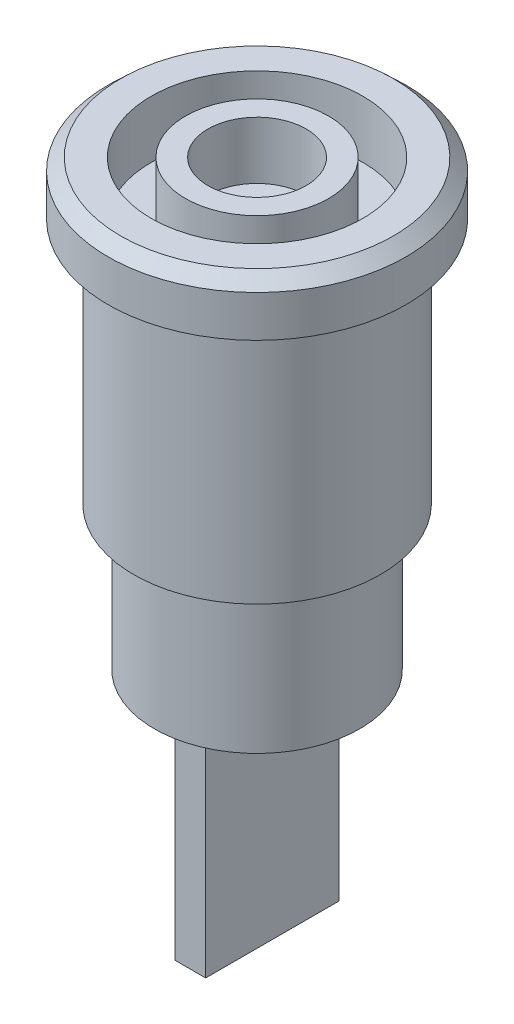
ISO-10303-21;
HEADER;
FILE_DESCRIPTION(('STEP AP214'),'2;1');
FILE_NAME('part.step','',(''),(''),'','','');
FILE_SCHEMA(('AUTOMOTIVE_DESIGN { 1 0 10303 214 1 1 1 1 }'));
ENDSEC;
DATA;
#1=APPLICATION_CONTEXT('core data for automotive mechanical design processes');
#2=APPLICATION_PROTOCOL_DEFINITION('international standard','automotive_design',2000,#1);
#3=PRODUCT_CONTEXT('',#1,'mechanical');
#4=PRODUCT('Part','Part','',(#3));
#5=PRODUCT_RELATED_PRODUCT_CATEGORY('part','',(#4));
#6=PRODUCT_DEFINITION_FORMATION('','',#4);
#7=PRODUCT_DEFINITION_CONTEXT('part definition',#1,'design');
#8=PRODUCT_DEFINITION('design','',#6,#7);
#9=PRODUCT_DEFINITION_SHAPE('','',#8);
#10=(LENGTH_UNIT() NAMED_UNIT(*) SI_UNIT(.MILLI.,.METRE.));
#11=(NAMED_UNIT(*) PLANE_ANGLE_UNIT() SI_UNIT($,.RADIAN.));
#12=(NAMED_UNIT(*) SI_UNIT($,.STERADIAN.) SOLID_ANGLE_UNIT());
#13=UNCERTAINTY_MEASURE_WITH_UNIT(LENGTH_MEASURE(1.E-05),#10,'distance_accuracy_value','');
#14=(GEOMETRIC_REPRESENTATION_CONTEXT(3) GLOBAL_UNCERTAINTY_ASSIGNED_CONTEXT((#13)) GLOBAL_UNIT_ASSIGNED_CONTEXT((#10,
#11,#12)) REPRESENTATION_CONTEXT('',''));
#15=CARTESIAN_POINT('',(0.,0.,0.));
#16=DIRECTION('',(0.,0.,1.));
#17=DIRECTION('',(1.,0.,0.));
#18=AXIS2_PLACEMENT_3D('',#15,#16,#17);
#19=CARTESIAN_POINT('',(0.,0.,0.));
#20=DIRECTION('',(0.,-1.,0.));
#21=DIRECTION('',(0.,0.,-1.));
#22=AXIS2_PLACEMENT_3D('',#19,#20,#21);
#23=PLANE('',#22);
#24=CARTESIAN_POINT('',(0.,0.,0.));
#25=DIRECTION('',(0.,-1.,0.));
#26=DIRECTION('',(0.,0.,-1.));
#27=AXIS2_PLACEMENT_3D('',#24,#25,#26);
#28=CIRCLE('',#27,5.);
#29=CARTESIAN_POINT('',(0.,0.,-5.));
#30=VERTEX_POINT('',#29);
#31=EDGE_CURVE('E11',#30,#30,#28,.T.);
#32=ORIENTED_EDGE('',*,*,#31,.T.);
#33=EDGE_LOOP('',(#32));
#34=FACE_BOUND('',#33,.T.);
#35=DIRECTION('',(-1.,0.,0.));
#36=VECTOR('',#35,1.);
#37=CARTESIAN_POINT('',(-0.750000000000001,0.,3.25));
#38=LINE('',#37,#36);
#39=CARTESIAN_POINT('',(0.749999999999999,0.,3.25));
#40=VERTEX_POINT('',#39);
#41=CARTESIAN_POINT('',(-0.750000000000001,0.,3.25));
#42=VERTEX_POINT('',#41);
#43=EDGE_CURVE('E85',#40,#42,#38,.T.);
#44=ORIENTED_EDGE('',*,*,#43,.F.);
#45=DIRECTION('',(0.,0.,1.));
#46=VECTOR('',#45,1.);
#47=CARTESIAN_POINT('',(0.749999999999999,0.,3.25));
#48=LINE('',#47,#46);
#49=CARTESIAN_POINT('',(0.75,0.,-3.25));
#50=VERTEX_POINT('',#49);
#51=EDGE_CURVE('E96',#50,#40,#48,.T.);
#52=ORIENTED_EDGE('',*,*,#51,.F.);
#53=DIRECTION('',(1.,0.,0.));
#54=VECTOR('',#53,1.);
#55=CARTESIAN_POINT('',(-0.75,0.,-3.25));
#56=LINE('',#55,#54);
#57=CARTESIAN_POINT('',(-0.75,0.,-3.25));
#58=VERTEX_POINT('',#57);
#59=EDGE_CURVE('E66',#58,#50,#56,.T.);
#60=ORIENTED_EDGE('',*,*,#59,.F.);
#61=DIRECTION('',(0.,0.,-1.));
#62=VECTOR('',#61,1.);
#63=CARTESIAN_POINT('',(-0.750000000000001,0.,3.25));
#64=LINE('',#63,#62);
#65=EDGE_CURVE('E100',#42,#58,#64,.T.);
#66=ORIENTED_EDGE('',*,*,#65,.F.);
#67=EDGE_LOOP('',(#44,#52,#60,#66));
#68=FACE_BOUND('',#67,.T.);
#69=ADVANCED_FACE('F30',(#34,#68),#23,.T.);
#70=CARTESIAN_POINT('',(0.,0.,0.));
#71=DIRECTION('',(0.,-1.,0.));
#72=DIRECTION('',(0.,0.,-1.));
#73=AXIS2_PLACEMENT_3D('',#70,#71,#72);
#74=CYLINDRICAL_SURFACE('',#73,5.);
#75=CARTESIAN_POINT('',(0.,7.,0.));
#76=DIRECTION('',(0.,-1.,0.));
#77=DIRECTION('',(0.,0.,-1.));
#78=AXIS2_PLACEMENT_3D('',#75,#76,#77);
#79=CIRCLE('',#78,5.);
#80=CARTESIAN_POINT('',(0.,7.,-5.));
#81=VERTEX_POINT('',#80);
#82=EDGE_CURVE('E37',#81,#81,#79,.T.);
#83=ORIENTED_EDGE('',*,*,#82,.T.);
#84=EDGE_LOOP('',(#83));
#85=FACE_BOUND('',#84,.T.);
#86=ORIENTED_EDGE('',*,*,#31,.F.);
#87=EDGE_LOOP('',(#86));
#88=FACE_BOUND('',#87,.T.);
#89=ADVANCED_FACE('F141',(#85,#88),#74,.T.);
#90=CARTESIAN_POINT('',(5.,7.,0.));
#91=DIRECTION('',(0.,-1.,0.));
#92=DIRECTION('',(0.,0.,-1.));
#93=AXIS2_PLACEMENT_3D('',#90,#91,#92);
#94=PLANE('',#93);
#95=CARTESIAN_POINT('',(0.,7.,0.));
#96=DIRECTION('',(0.,-1.,0.));
#97=DIRECTION('',(0.,0.,-1.));
#98=AXIS2_PLACEMENT_3D('',#95,#96,#97);
#99=CIRCLE('',#98,6.);
#100=CARTESIAN_POINT('',(0.,7.,-6.));
#101=VERTEX_POINT('',#100);
#102=EDGE_CURVE('E136',#101,#101,#99,.T.);
#103=ORIENTED_EDGE('',*,*,#102,.T.);
#104=EDGE_LOOP('',(#103));
#105=FACE_BOUND('',#104,.T.);
#106=ORIENTED_EDGE('',*,*,#82,.F.);
#107=EDGE_LOOP('',(#106));
#108=FACE_BOUND('',#107,.T.);
#109=ADVANCED_FACE('F144',(#105,#108),#94,.T.);
#110=CARTESIAN_POINT('',(0.,0.,0.));
#111=DIRECTION('',(0.,-1.,0.));
#112=DIRECTION('',(0.,0.,-1.));
#113=AXIS2_PLACEMENT_3D('',#110,#111,#112);
#114=CYLINDRICAL_SURFACE('',#113,6.);
#115=CARTESIAN_POINT('',(0.,19.,0.));
#116=DIRECTION('',(0.,-1.,0.));
#117=DIRECTION('',(0.,0.,-1.));
#118=AXIS2_PLACEMENT_3D('',#115,#116,#117);
#119=CIRCLE('',#118,6.);
#120=CARTESIAN_POINT('',(0.,19.,-6.));
#121=VERTEX_POINT('',#120);
#122=EDGE_CURVE('E133',#121,#121,#119,.T.);
#123=ORIENTED_EDGE('',*,*,#122,.T.);
#124=EDGE_LOOP('',(#123));
#125=FACE_BOUND('',#124,.T.);
#126=ORIENTED_EDGE('',*,*,#102,.F.);
#127=EDGE_LOOP('',(#126));
#128=FACE_BOUND('',#127,.T.);
#129=ADVANCED_FACE('F146',(#125,#128),#114,.T.);
#130=CARTESIAN_POINT('',(6.,19.,0.));
#131=DIRECTION('',(0.,-1.,0.));
#132=DIRECTION('',(0.,0.,-1.));
#133=AXIS2_PLACEMENT_3D('',#130,#131,#132);
#134=PLANE('',#133);
#135=CARTESIAN_POINT('',(0.,19.,0.));
#136=DIRECTION('',(0.,-1.,0.));
#137=DIRECTION('',(0.,0.,-1.));
#138=AXIS2_PLACEMENT_3D('',#135,#136,#137);
#139=CIRCLE('',#138,7.24653536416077);
#140=CARTESIAN_POINT('',(0.,19.,-7.24653536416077));
#141=VERTEX_POINT('',#140);
#142=EDGE_CURVE('E130',#141,#141,#139,.T.);
#143=ORIENTED_EDGE('',*,*,#142,.T.);
#144=EDGE_LOOP('',(#143));
#145=FACE_BOUND('',#144,.T.);
#146=ORIENTED_EDGE('',*,*,#122,.F.);
#147=EDGE_LOOP('',(#146));
#148=FACE_BOUND('',#147,.T.);
#149=ADVANCED_FACE('F153',(#145,#148),#134,.T.);
#150=CARTESIAN_POINT('',(0.,0.,0.));
#151=DIRECTION('',(0.,-1.,0.));
#152=DIRECTION('',(0.,0.,-1.));
#153=AXIS2_PLACEMENT_3D('',#150,#151,#152);
#154=CYLINDRICAL_SURFACE('',#153,7.24653536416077);
#155=CARTESIAN_POINT('',(0.,21.0172799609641,0.));
#156=DIRECTION('',(0.,-1.,0.));
#157=DIRECTION('',(0.,0.,-1.));
#158=AXIS2_PLACEMENT_3D('',#155,#156,#157);
#159=CIRCLE('',#158,7.24653536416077);
#160=CARTESIAN_POINT('',(0.,21.0172799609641,-7.24653536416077));
#161=VERTEX_POINT('',#160);
#162=EDGE_CURVE('E127',#161,#161,#159,.T.);
#163=ORIENTED_EDGE('',*,*,#162,.T.);
#164=EDGE_LOOP('',(#163));
#165=FACE_BOUND('',#164,.T.);
#166=ORIENTED_EDGE('',*,*,#142,.F.);
#167=EDGE_LOOP('',(#166));
#168=FACE_BOUND('',#167,.T.);
#169=ADVANCED_FACE('F210',(#165,#168),#154,.T.);
#170=CARTESIAN_POINT('',(0.,21.0172799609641,0.));
#171=DIRECTION('',(0.,-1.,0.));
#172=DIRECTION('',(0.,0.,-1.));
#173=AXIS2_PLACEMENT_3D('',#170,#171,#172);
#174=CONICAL_SURFACE('',#173,7.24653536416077,0.81387347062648);
#175=CARTESIAN_POINT('',(0.,21.5938165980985,0.));
#176=DIRECTION('',(0.,-1.,0.));
#177=DIRECTION('',(0.,0.,-1.));
#178=AXIS2_PLACEMENT_3D('',#175,#176,#177);
#179=CIRCLE('',#178,6.63619284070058);
#180=CARTESIAN_POINT('',(0.,21.5938165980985,-6.63619284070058));
#181=VERTEX_POINT('',#180);
#182=EDGE_CURVE('E124',#181,#181,#179,.T.);
#183=ORIENTED_EDGE('',*,*,#182,.T.);
#184=EDGE_LOOP('',(#183));
#185=FACE_BOUND('',#184,.T.);
#186=ORIENTED_EDGE('',*,*,#162,.F.);
#187=EDGE_LOOP('',(#186));
#188=FACE_BOUND('',#187,.T.);
#189=ADVANCED_FACE('F206',(#185,#188),#174,.T.);
#190=CARTESIAN_POINT('',(6.63619284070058,21.5938165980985,0.));
#191=DIRECTION('',(0.,1.,0.));
#192=DIRECTION('',(0.,0.,1.));
#193=AXIS2_PLACEMENT_3D('',#190,#191,#192);
#194=PLANE('',#193);
#195=CARTESIAN_POINT('',(0.,21.5938165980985,0.));
#196=DIRECTION('',(0.,-1.,0.));
#197=DIRECTION('',(0.,0.,-1.));
#198=AXIS2_PLACEMENT_3D('',#195,#196,#197);
#199=CIRCLE('',#198,5.15373863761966);
#200=CARTESIAN_POINT('',(0.,21.5938165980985,-5.15373863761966));
#201=VERTEX_POINT('',#200);
#202=EDGE_CURVE('E121',#201,#201,#199,.T.);
#203=ORIENTED_EDGE('',*,*,#202,.T.);
#204=EDGE_LOOP('',(#203));
#205=FACE_BOUND('',#204,.T.);
#206=ORIENTED_EDGE('',*,*,#182,.F.);
#207=EDGE_LOOP('',(#206));
#208=FACE_BOUND('',#207,.T.);
#209=ADVANCED_FACE('F202',(#205,#208),#194,.T.);
#210=CARTESIAN_POINT('',(0.,0.,0.));
#211=DIRECTION('',(0.,-1.,0.));
#212=DIRECTION('',(0.,0.,-1.));
#213=AXIS2_PLACEMENT_3D('',#210,#211,#212);
#214=CYLINDRICAL_SURFACE('',#213,5.15373863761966);
#215=CARTESIAN_POINT('',(0.,18.8017697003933,0.));
#216=DIRECTION('',(0.,-1.,0.));
#217=DIRECTION('',(0.,0.,-1.));
#218=AXIS2_PLACEMENT_3D('',#215,#216,#217);
#219=CIRCLE('',#218,5.15373863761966);
#220=CARTESIAN_POINT('',(0.,18.8017697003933,-5.15373863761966));
#221=VERTEX_POINT('',#220);
#222=EDGE_CURVE('E118',#221,#221,#219,.T.);
#223=ORIENTED_EDGE('',*,*,#222,.T.);
#224=EDGE_LOOP('',(#223));
#225=FACE_BOUND('',#224,.T.);
#226=ORIENTED_EDGE('',*,*,#202,.F.);
#227=EDGE_LOOP('',(#226));
#228=FACE_BOUND('',#227,.T.);
#229=ADVANCED_FACE('F198',(#225,#228),#214,.F.);
#230=CARTESIAN_POINT('',(5.15373863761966,18.8017697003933,0.));
#231=DIRECTION('',(0.,1.,0.));
#232=DIRECTION('',(0.,0.,1.));
#233=AXIS2_PLACEMENT_3D('',#230,#231,#232);
#234=PLANE('',#233);
#235=CARTESIAN_POINT('',(0.,18.8017697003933,0.));
#236=DIRECTION('',(0.,-1.,0.));
#237=DIRECTION('',(0.,0.,-1.));
#238=AXIS2_PLACEMENT_3D('',#235,#236,#237);
#239=CIRCLE('',#238,3.48178238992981);
#240=CARTESIAN_POINT('',(0.,18.8017697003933,-3.48178238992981));
#241=VERTEX_POINT('',#240);
#242=EDGE_CURVE('E115',#241,#241,#239,.T.);
#243=ORIENTED_EDGE('',*,*,#242,.T.);
#244=EDGE_LOOP('',(#243));
#245=FACE_BOUND('',#244,.T.);
#246=ORIENTED_EDGE('',*,*,#222,.F.);
#247=EDGE_LOOP('',(#246));
#248=FACE_BOUND('',#247,.T.);
#249=ADVANCED_FACE('F194',(#245,#248),#234,.T.);
#250=CARTESIAN_POINT('',(0.,0.,0.));
#251=DIRECTION('',(0.,-1.,0.));
#252=DIRECTION('',(0.,0.,-1.));
#253=AXIS2_PLACEMENT_3D('',#250,#251,#252);
#254=CYLINDRICAL_SURFACE('',#253,3.48178238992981);
#255=CARTESIAN_POINT('',(0.,21.5938165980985,0.));
#256=DIRECTION('',(0.,-1.,0.));
#257=DIRECTION('',(0.,0.,-1.));
#258=AXIS2_PLACEMENT_3D('',#255,#256,#257);
#259=CIRCLE('',#258,3.48178238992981);
#260=CARTESIAN_POINT('',(0.,21.5938165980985,-3.48178238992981));
#261=VERTEX_POINT('',#260);
#262=EDGE_CURVE('E112',#261,#261,#259,.T.);
#263=ORIENTED_EDGE('',*,*,#262,.T.);
#264=EDGE_LOOP('',(#263));
#265=FACE_BOUND('',#264,.T.);
#266=ORIENTED_EDGE('',*,*,#242,.F.);
#267=EDGE_LOOP('',(#266));
#268=FACE_BOUND('',#267,.T.);
#269=ADVANCED_FACE('F190',(#265,#268),#254,.T.);
#270=CARTESIAN_POINT('',(3.48178238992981,21.5938165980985,0.));
#271=DIRECTION('',(0.,1.,0.));
#272=DIRECTION('',(0.,0.,1.));
#273=AXIS2_PLACEMENT_3D('',#270,#271,#272);
#274=PLANE('',#273);
#275=CARTESIAN_POINT('',(0.,21.5938165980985,0.));
#276=DIRECTION('',(0.,-1.,0.));
#277=DIRECTION('',(0.,0.,-1.));
#278=AXIS2_PLACEMENT_3D('',#275,#276,#277);
#279=CIRCLE('',#278,2.39168235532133);
#280=CARTESIAN_POINT('',(0.,21.5938165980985,-2.39168235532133));
#281=VERTEX_POINT('',#280);
#282=EDGE_CURVE('E109',#281,#281,#279,.T.);
#283=ORIENTED_EDGE('',*,*,#282,.T.);
#284=EDGE_LOOP('',(#283));
#285=FACE_BOUND('',#284,.T.);
#286=ORIENTED_EDGE('',*,*,#262,.F.);
#287=EDGE_LOOP('',(#286));
#288=FACE_BOUND('',#287,.T.);
#289=ADVANCED_FACE('F186',(#285,#288),#274,.T.);
#290=CARTESIAN_POINT('',(0.,0.,0.));
#291=DIRECTION('',(0.,-1.,0.));
#292=DIRECTION('',(0.,0.,-1.));
#293=AXIS2_PLACEMENT_3D('',#290,#291,#292);
#294=CYLINDRICAL_SURFACE('',#293,2.39168235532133);
#295=CARTESIAN_POINT('',(0.,18.8017697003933,0.));
#296=DIRECTION('',(0.,-1.,0.));
#297=DIRECTION('',(0.,0.,-1.));
#298=AXIS2_PLACEMENT_3D('',#295,#296,#297);
#299=CIRCLE('',#298,2.39168235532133);
#300=CARTESIAN_POINT('',(0.,18.8017697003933,-2.39168235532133));
#301=VERTEX_POINT('',#300);
#302=EDGE_CURVE('E106',#301,#301,#299,.T.);
#303=ORIENTED_EDGE('',*,*,#302,.T.);
#304=EDGE_LOOP('',(#303));
#305=FACE_BOUND('',#304,.T.);
#306=ORIENTED_EDGE('',*,*,#282,.F.);
#307=EDGE_LOOP('',(#306));
#308=FACE_BOUND('',#307,.T.);
#309=ADVANCED_FACE('F182',(#305,#308),#294,.F.);
#310=CARTESIAN_POINT('',(2.39168235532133,18.8017697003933,0.));
#311=DIRECTION('',(0.,1.,0.));
#312=DIRECTION('',(0.,0.,1.));
#313=AXIS2_PLACEMENT_3D('',#310,#311,#312);
#314=PLANE('',#313);
#315=ORIENTED_EDGE('',*,*,#302,.F.);
#316=EDGE_LOOP('',(#315));
#317=FACE_BOUND('',#316,.T.);
#318=ADVANCED_FACE('F179',(#317),#314,.T.);
#319=CARTESIAN_POINT('',(0.749999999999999,-11.,3.25));
#320=DIRECTION('',(-1.,0.,0.));
#321=DIRECTION('',(0.,0.,1.));
#322=AXIS2_PLACEMENT_3D('',#319,#320,#321);
#323=PLANE('',#322);
#324=ORIENTED_EDGE('',*,*,#51,.T.);
#325=DIRECTION('',(0.,1.,0.));
#326=VECTOR('',#325,1.);
#327=CARTESIAN_POINT('',(0.749999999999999,-11.,3.25));
#328=LINE('',#327,#326);
#329=CARTESIAN_POINT('',(0.749999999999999,-11.,3.25));
#330=VERTEX_POINT('',#329);
#331=EDGE_CURVE('E88',#330,#40,#328,.T.);
#332=ORIENTED_EDGE('',*,*,#331,.F.);
#333=DIRECTION('',(0.,0.,1.));
#334=VECTOR('',#333,1.);
#335=CARTESIAN_POINT('',(0.749999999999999,-11.,3.25));
#336=LINE('',#335,#334);
#337=CARTESIAN_POINT('',(0.75,-11.,-3.25));
#338=VERTEX_POINT('',#337);
#339=EDGE_CURVE('E78',#338,#330,#336,.T.);
#340=ORIENTED_EDGE('',*,*,#339,.F.);
#341=DIRECTION('',(0.,1.,0.));
#342=VECTOR('',#341,1.);
#343=CARTESIAN_POINT('',(0.75,-11.,-3.25));
#344=LINE('',#343,#342);
#345=EDGE_CURVE('E92',#338,#50,#344,.T.);
#346=ORIENTED_EDGE('',*,*,#345,.T.);
#347=EDGE_LOOP('',(#324,#332,#340,#346));
#348=FACE_BOUND('',#347,.T.);
#349=ADVANCED_FACE('F164',(#348),#323,.F.);
#350=CARTESIAN_POINT('',(-0.750000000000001,-11.,3.25));
#351=DIRECTION('',(0.,0.,-1.));
#352=DIRECTION('',(-1.,0.,0.));
#353=AXIS2_PLACEMENT_3D('',#350,#351,#352);
#354=PLANE('',#353);
#355=ORIENTED_EDGE('',*,*,#43,.T.);
#356=DIRECTION('',(0.,1.,0.));
#357=VECTOR('',#356,1.);
#358=CARTESIAN_POINT('',(-0.750000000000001,-11.,3.25));
#359=LINE('',#358,#357);
#360=CARTESIAN_POINT('',(-0.750000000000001,-11.,3.25));
#361=VERTEX_POINT('',#360);
#362=EDGE_CURVE('E82',#361,#42,#359,.T.);
#363=ORIENTED_EDGE('',*,*,#362,.F.);
#364=DIRECTION('',(-1.,0.,0.));
#365=VECTOR('',#364,1.);
#366=CARTESIAN_POINT('',(-0.750000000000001,-11.,3.25));
#367=LINE('',#366,#365);
#368=EDGE_CURVE('E73',#330,#361,#367,.T.);
#369=ORIENTED_EDGE('',*,*,#368,.F.);
#370=ORIENTED_EDGE('',*,*,#331,.T.);
#371=EDGE_LOOP('',(#355,#363,#369,#370));
#372=FACE_BOUND('',#371,.T.);
#373=ADVANCED_FACE('F83',(#372),#354,.F.);
#374=CARTESIAN_POINT('',(-0.750000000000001,-11.,3.25));
#375=DIRECTION('',(1.,0.,0.));
#376=DIRECTION('',(0.,0.,-1.));
#377=AXIS2_PLACEMENT_3D('',#374,#375,#376);
#378=PLANE('',#377);
#379=ORIENTED_EDGE('',*,*,#65,.T.);
#380=DIRECTION('',(0.,1.,0.));
#381=VECTOR('',#380,1.);
#382=CARTESIAN_POINT('',(-0.75,-11.,-3.25));
#383=LINE('',#382,#381);
#384=CARTESIAN_POINT('',(-0.75,-11.,-3.25));
#385=VERTEX_POINT('',#384);
#386=EDGE_CURVE('E44',#385,#58,#383,.T.);
#387=ORIENTED_EDGE('',*,*,#386,.F.);
#388=DIRECTION('',(0.,0.,-1.));
#389=VECTOR('',#388,1.);
#390=CARTESIAN_POINT('',(-0.750000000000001,-11.,3.25));
#391=LINE('',#390,#389);
#392=EDGE_CURVE('E76',#361,#385,#391,.T.);
#393=ORIENTED_EDGE('',*,*,#392,.F.);
#394=ORIENTED_EDGE('',*,*,#362,.T.);
#395=EDGE_LOOP('',(#379,#387,#393,#394));
#396=FACE_BOUND('',#395,.T.);
#397=ADVANCED_FACE('F90',(#396),#378,.F.);
#398=CARTESIAN_POINT('',(-0.75,-11.,-3.25));
#399=DIRECTION('',(0.,0.,1.));
#400=DIRECTION('',(1.,0.,0.));
#401=AXIS2_PLACEMENT_3D('',#398,#399,#400);
#402=PLANE('',#401);
#403=ORIENTED_EDGE('',*,*,#59,.T.);
#404=ORIENTED_EDGE('',*,*,#345,.F.);
#405=DIRECTION('',(1.,0.,0.));
#406=VECTOR('',#405,1.);
#407=CARTESIAN_POINT('',(-0.75,-11.,-3.25));
#408=LINE('',#407,#406);
#409=EDGE_CURVE('E52',#385,#338,#408,.T.);
#410=ORIENTED_EDGE('',*,*,#409,.F.);
#411=ORIENTED_EDGE('',*,*,#386,.T.);
#412=EDGE_LOOP('',(#403,#404,#410,#411));
#413=FACE_BOUND('',#412,.T.);
#414=ADVANCED_FACE('F165',(#413),#402,.F.);
#415=CARTESIAN_POINT('',(0.75,-11.,-3.25));
#416=DIRECTION('',(0.,-1.,0.));
#417=DIRECTION('',(0.,0.,-1.));
#418=AXIS2_PLACEMENT_3D('',#415,#416,#417);
#419=PLANE('',#418);
#420=ORIENTED_EDGE('',*,*,#339,.T.);
#421=ORIENTED_EDGE('',*,*,#368,.T.);
#422=ORIENTED_EDGE('',*,*,#392,.T.);
#423=ORIENTED_EDGE('',*,*,#409,.T.);
#424=EDGE_LOOP('',(#420,#421,#422,#423));
#425=FACE_BOUND('',#424,.T.);
#426=ADVANCED_FACE('F74',(#425),#419,.T.);
#427=CLOSED_SHELL('',(#69,#89,#109,#129,#149,#169,#189,#209,#229,#249,#269,#289,#309,#318,#349,
#373,#397,#414,#426));
#428=MANIFOLD_SOLID_BREP('B2',#427);
#429=ADVANCED_BREP_SHAPE_REPRESENTATION('',(#18,#428),#14);
#430=SHAPE_DEFINITION_REPRESENTATION(#9,#429);
ENDSEC;
END-ISO-10303-21;
